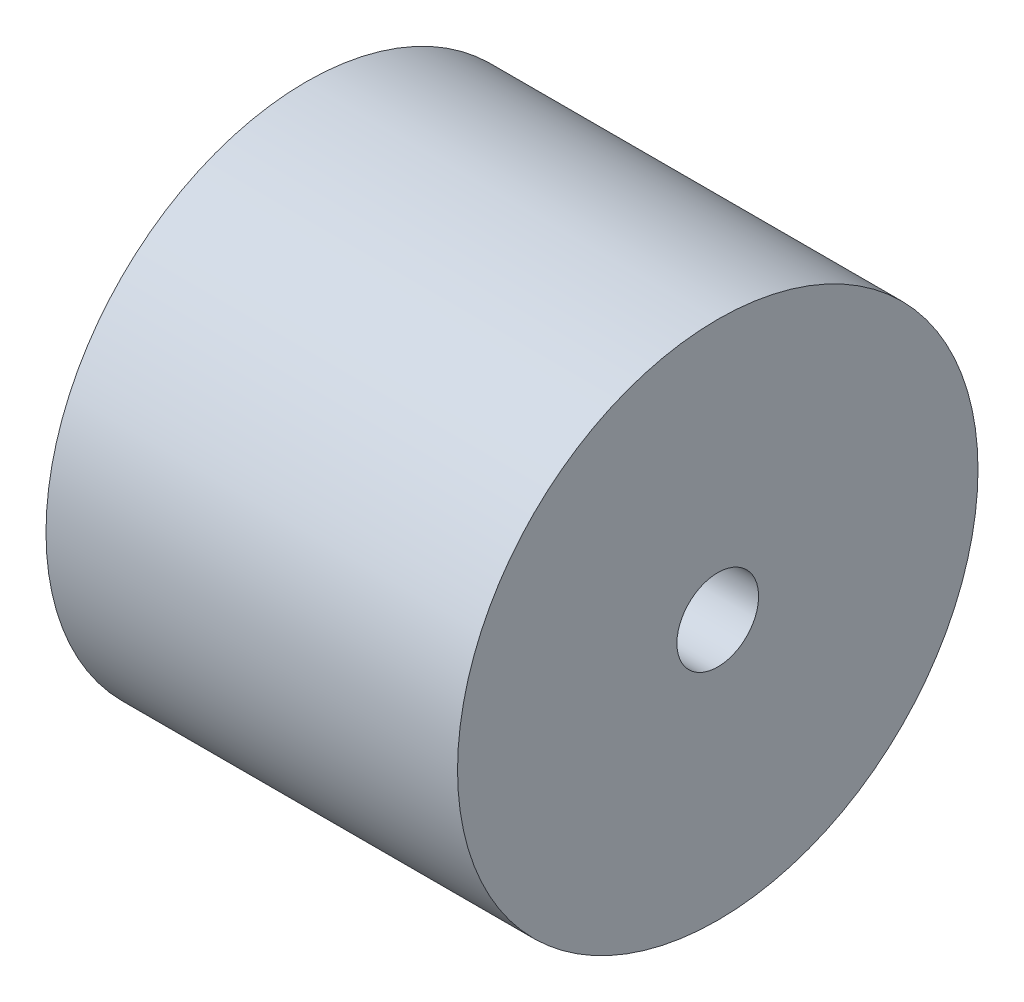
from build123d import *

# Parameters (mm, degrees)
ESQUISSE1_R             = 43
BOSS_EXTRU_1_DEPTH      = 34
ESQUISSE2_R             = 6.75
ENL_V_MAT_EXTRU_1_DEPTH = 92.224996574


with BuildPart() as part:
    # Esquisse1 → Boss.-Extru.1 (new, symmetric)
    with BuildSketch(Plane(origin=(0, 0, 0), x_dir=(0, 0, -1), z_dir=(1, 0, 0))):
        Circle(ESQUISSE1_R)
    extrude(amount=BOSS_EXTRU_1_DEPTH, both=True)

    # Esquisse2 → Enl_v. mat.-Extru.1 (cut, through all)
    with BuildSketch(Plane.ZY.offset(34)):
        Circle(ESQUISSE2_R)
    extrude(amount=-ENL_V_MAT_EXTRU_1_DEPTH, mode=Mode.SUBTRACT)


solid = part.part
